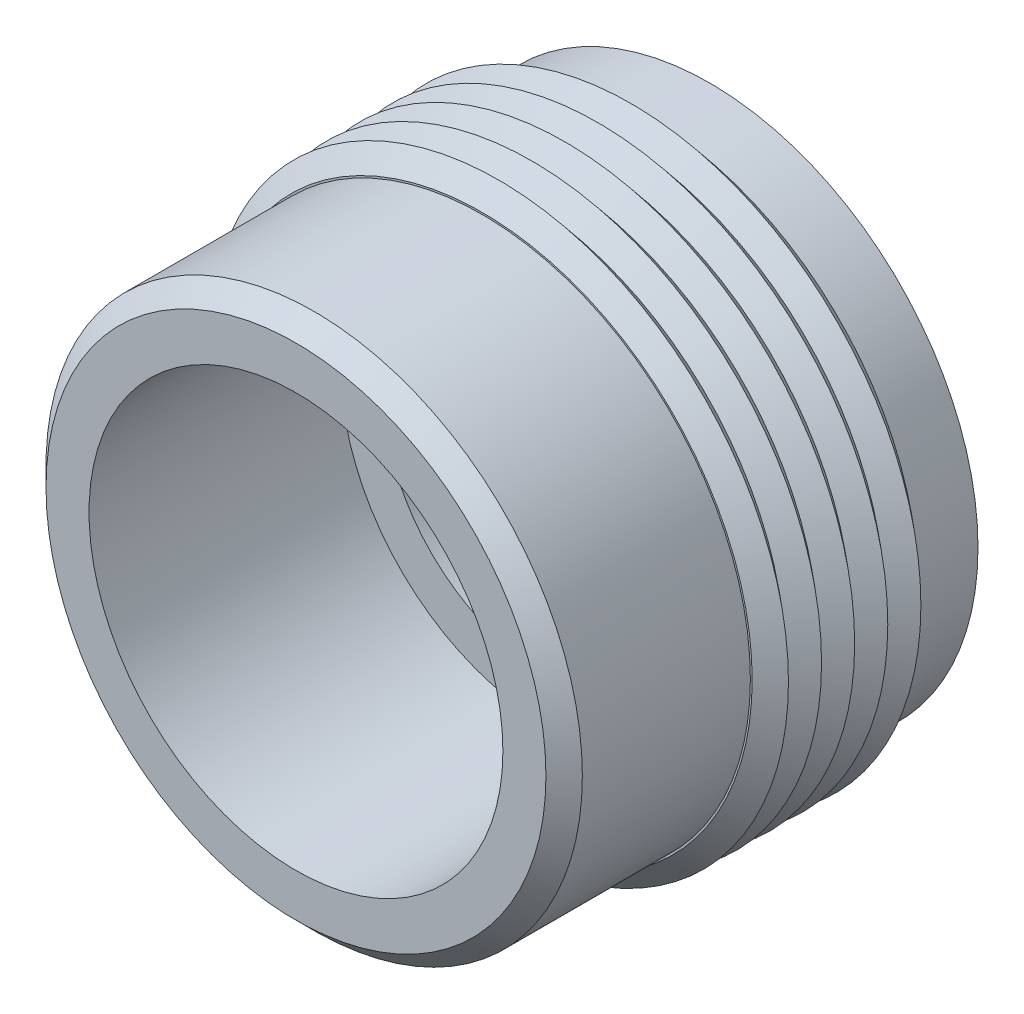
ISO-10303-21;
HEADER;
FILE_DESCRIPTION(('STEP AP214'),'2;1');
FILE_NAME('part.step','',(''),(''),'','','');
FILE_SCHEMA(('AUTOMOTIVE_DESIGN { 1 0 10303 214 1 1 1 1 }'));
ENDSEC;
DATA;
#1=APPLICATION_CONTEXT('core data for automotive mechanical design processes');
#2=APPLICATION_PROTOCOL_DEFINITION('international standard','automotive_design',2000,#1);
#3=PRODUCT_CONTEXT('',#1,'mechanical');
#4=PRODUCT('Part','Part','',(#3));
#5=PRODUCT_RELATED_PRODUCT_CATEGORY('part','',(#4));
#6=PRODUCT_DEFINITION_FORMATION('','',#4);
#7=PRODUCT_DEFINITION_CONTEXT('part definition',#1,'design');
#8=PRODUCT_DEFINITION('design','',#6,#7);
#9=PRODUCT_DEFINITION_SHAPE('','',#8);
#10=(LENGTH_UNIT() NAMED_UNIT(*) SI_UNIT(.MILLI.,.METRE.));
#11=(NAMED_UNIT(*) PLANE_ANGLE_UNIT() SI_UNIT($,.RADIAN.));
#12=(NAMED_UNIT(*) SI_UNIT($,.STERADIAN.) SOLID_ANGLE_UNIT());
#13=UNCERTAINTY_MEASURE_WITH_UNIT(LENGTH_MEASURE(1.E-05),#10,'distance_accuracy_value','');
#14=(GEOMETRIC_REPRESENTATION_CONTEXT(3) GLOBAL_UNCERTAINTY_ASSIGNED_CONTEXT((#13)) GLOBAL_UNIT_ASSIGNED_CONTEXT((#10,
#11,#12)) REPRESENTATION_CONTEXT('',''));
#15=CARTESIAN_POINT('',(0.,0.,0.));
#16=DIRECTION('',(0.,0.,1.));
#17=DIRECTION('',(1.,0.,0.));
#18=AXIS2_PLACEMENT_3D('',#15,#16,#17);
#19=CARTESIAN_POINT('',(0.,10.287,15.875));
#20=DIRECTION('',(0.,0.,-1.));
#21=DIRECTION('',(-1.,0.,0.));
#22=AXIS2_PLACEMENT_3D('',#19,#20,#21);
#23=PLANE('',#22);
#24=CARTESIAN_POINT('',(0.,0.,15.875));
#25=DIRECTION('',(0.,0.,1.));
#26=DIRECTION('',(1.,0.,0.));
#27=AXIS2_PLACEMENT_3D('',#24,#25,#26);
#28=CIRCLE('',#27,7.9375);
#29=CARTESIAN_POINT('',(7.9375,0.,15.875));
#30=VERTEX_POINT('',#29);
#31=EDGE_CURVE('E54',#30,#30,#28,.T.);
#32=ORIENTED_EDGE('',*,*,#31,.F.);
#33=EDGE_LOOP('',(#32));
#34=FACE_BOUND('',#33,.T.);
#35=CARTESIAN_POINT('',(0.,0.,15.875));
#36=DIRECTION('',(0.,0.,1.));
#37=DIRECTION('',(1.,0.,0.));
#38=AXIS2_PLACEMENT_3D('',#35,#36,#37);
#39=CIRCLE('',#38,9.5885);
#40=CARTESIAN_POINT('',(9.5885,0.,15.875));
#41=VERTEX_POINT('',#40);
#42=EDGE_CURVE('E99',#41,#41,#39,.T.);
#43=ORIENTED_EDGE('',*,*,#42,.T.);
#44=EDGE_LOOP('',(#43));
#45=FACE_BOUND('',#44,.T.);
#46=ADVANCED_FACE('F34',(#34,#45),#23,.F.);
#47=CARTESIAN_POINT('',(0.,0.,0.));
#48=DIRECTION('',(0.,0.,1.));
#49=DIRECTION('',(1.,0.,0.));
#50=AXIS2_PLACEMENT_3D('',#47,#48,#49);
#51=CYLINDRICAL_SURFACE('',#50,10.287);
#52=CARTESIAN_POINT('',(0.,0.,8.73125000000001));
#53=DIRECTION('',(0.,0.,1.));
#54=DIRECTION('',(1.,0.,0.));
#55=AXIS2_PLACEMENT_3D('',#52,#53,#54);
#56=CIRCLE('',#55,10.287);
#57=CARTESIAN_POINT('',(10.287,0.,8.73125000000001));
#58=VERTEX_POINT('',#57);
#59=EDGE_CURVE('E10',#58,#58,#56,.T.);
#60=ORIENTED_EDGE('',*,*,#59,.T.);
#61=EDGE_LOOP('',(#60));
#62=FACE_BOUND('',#61,.T.);
#63=CARTESIAN_POINT('',(0.,0.,15.1765));
#64=DIRECTION('',(0.,0.,1.));
#65=DIRECTION('',(1.,0.,0.));
#66=AXIS2_PLACEMENT_3D('',#63,#64,#65);
#67=CIRCLE('',#66,10.287);
#68=CARTESIAN_POINT('',(10.287,0.,15.1765));
#69=VERTEX_POINT('',#68);
#70=EDGE_CURVE('E96',#69,#69,#67,.T.);
#71=ORIENTED_EDGE('',*,*,#70,.F.);
#72=EDGE_LOOP('',(#71));
#73=FACE_BOUND('',#72,.T.);
#74=ADVANCED_FACE('F116',(#62,#73),#51,.T.);
#75=CARTESIAN_POINT('',(0.,10.287,2.38125));
#76=DIRECTION('',(0.,0.,1.));
#77=DIRECTION('',(1.,0.,0.));
#78=AXIS2_PLACEMENT_3D('',#75,#76,#77);
#79=PLANE('',#78);
#80=CARTESIAN_POINT('',(0.,0.,2.38125000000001));
#81=DIRECTION('',(0.,0.,1.));
#82=DIRECTION('',(1.,0.,0.));
#83=AXIS2_PLACEMENT_3D('',#80,#81,#82);
#84=CIRCLE('',#83,10.35685);
#85=CARTESIAN_POINT('',(10.35685,0.,2.38125000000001));
#86=VERTEX_POINT('',#85);
#87=EDGE_CURVE('E61',#86,#86,#84,.T.);
#88=ORIENTED_EDGE('',*,*,#87,.F.);
#89=EDGE_LOOP('',(#88));
#90=FACE_BOUND('',#89,.T.);
#91=CARTESIAN_POINT('',(0.,0.,2.38125));
#92=DIRECTION('',(0.,0.,1.));
#93=DIRECTION('',(1.,0.,0.));
#94=AXIS2_PLACEMENT_3D('',#91,#92,#93);
#95=CIRCLE('',#94,10.287);
#96=CARTESIAN_POINT('',(10.287,0.,2.38125));
#97=VERTEX_POINT('',#96);
#98=EDGE_CURVE('E45',#97,#97,#95,.T.);
#99=ORIENTED_EDGE('',*,*,#98,.T.);
#100=EDGE_LOOP('',(#99));
#101=FACE_BOUND('',#100,.T.);
#102=ADVANCED_FACE('F36',(#90,#101),#79,.F.);
#103=CARTESIAN_POINT('',(0.,11.1125,8.73125000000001));
#104=DIRECTION('',(0.,0.,-1.));
#105=DIRECTION('',(-1.,0.,0.));
#106=AXIS2_PLACEMENT_3D('',#103,#104,#105);
#107=PLANE('',#106);
#108=CARTESIAN_POINT('',(0.,0.,8.73125000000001));
#109=DIRECTION('',(0.,0.,1.));
#110=DIRECTION('',(1.,0.,0.));
#111=AXIS2_PLACEMENT_3D('',#108,#109,#110);
#112=CIRCLE('',#111,10.35685);
#113=CARTESIAN_POINT('',(10.35685,0.,8.73125000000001));
#114=VERTEX_POINT('',#113);
#115=EDGE_CURVE('E93',#114,#114,#112,.T.);
#116=ORIENTED_EDGE('',*,*,#115,.T.);
#117=EDGE_LOOP('',(#116));
#118=FACE_BOUND('',#117,.T.);
#119=ORIENTED_EDGE('',*,*,#59,.F.);
#120=EDGE_LOOP('',(#119));
#121=FACE_BOUND('',#120,.T.);
#122=ADVANCED_FACE('F127',(#118,#121),#107,.F.);
#123=CARTESIAN_POINT('',(0.,10.287,0.));
#124=DIRECTION('',(0.,0.,1.));
#125=DIRECTION('',(1.,0.,0.));
#126=AXIS2_PLACEMENT_3D('',#123,#124,#125);
#127=PLANE('',#126);
#128=CARTESIAN_POINT('',(0.,0.,0.));
#129=DIRECTION('',(0.,0.,1.));
#130=DIRECTION('',(1.,0.,0.));
#131=AXIS2_PLACEMENT_3D('',#128,#129,#130);
#132=CIRCLE('',#131,6.2992);
#133=CARTESIAN_POINT('',(6.2992,0.,0.));
#134=VERTEX_POINT('',#133);
#135=EDGE_CURVE('E57',#134,#134,#132,.T.);
#136=ORIENTED_EDGE('',*,*,#135,.T.);
#137=EDGE_LOOP('',(#136));
#138=FACE_BOUND('',#137,.T.);
#139=CARTESIAN_POINT('',(0.,0.,0.));
#140=DIRECTION('',(0.,0.,1.));
#141=DIRECTION('',(1.,0.,0.));
#142=AXIS2_PLACEMENT_3D('',#139,#140,#141);
#143=CIRCLE('',#142,10.287);
#144=CARTESIAN_POINT('',(10.287,0.,0.));
#145=VERTEX_POINT('',#144);
#146=EDGE_CURVE('E41',#145,#145,#143,.T.);
#147=ORIENTED_EDGE('',*,*,#146,.F.);
#148=EDGE_LOOP('',(#147));
#149=FACE_BOUND('',#148,.T.);
#150=ADVANCED_FACE('F125',(#138,#149),#127,.F.);
#151=CARTESIAN_POINT('',(0.,0.,0.));
#152=DIRECTION('',(0.,0.,1.));
#153=DIRECTION('',(1.,0.,0.));
#154=AXIS2_PLACEMENT_3D('',#151,#152,#153);
#155=CYLINDRICAL_SURFACE('',#154,10.287);
#156=ORIENTED_EDGE('',*,*,#98,.F.);
#157=EDGE_LOOP('',(#156));
#158=FACE_BOUND('',#157,.T.);
#159=ORIENTED_EDGE('',*,*,#146,.T.);
#160=EDGE_LOOP('',(#159));
#161=FACE_BOUND('',#160,.T.);
#162=ADVANCED_FACE('F134',(#158,#161),#155,.T.);
#163=CARTESIAN_POINT('',(0.,7.9375,6.22300000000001));
#164=DIRECTION('',(0.,0.,1.));
#165=DIRECTION('',(1.,0.,0.));
#166=AXIS2_PLACEMENT_3D('',#163,#164,#165);
#167=PLANE('',#166);
#168=CARTESIAN_POINT('',(0.,0.,6.22300000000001));
#169=DIRECTION('',(0.,0.,1.));
#170=DIRECTION('',(1.,0.,0.));
#171=AXIS2_PLACEMENT_3D('',#168,#169,#170);
#172=CIRCLE('',#171,6.2992);
#173=CARTESIAN_POINT('',(6.2992,0.,6.22300000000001));
#174=VERTEX_POINT('',#173);
#175=EDGE_CURVE('E58',#174,#174,#172,.T.);
#176=ORIENTED_EDGE('',*,*,#175,.F.);
#177=EDGE_LOOP('',(#176));
#178=FACE_BOUND('',#177,.T.);
#179=CARTESIAN_POINT('',(0.,0.,6.22300000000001));
#180=DIRECTION('',(0.,0.,1.));
#181=DIRECTION('',(1.,0.,0.));
#182=AXIS2_PLACEMENT_3D('',#179,#180,#181);
#183=CIRCLE('',#182,7.9375);
#184=CARTESIAN_POINT('',(7.9375,0.,6.22300000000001));
#185=VERTEX_POINT('',#184);
#186=EDGE_CURVE('E49',#185,#185,#183,.T.);
#187=ORIENTED_EDGE('',*,*,#186,.T.);
#188=EDGE_LOOP('',(#187));
#189=FACE_BOUND('',#188,.T.);
#190=ADVANCED_FACE('F199',(#178,#189),#167,.T.);
#191=CARTESIAN_POINT('',(0.,0.,0.));
#192=DIRECTION('',(0.,0.,1.));
#193=DIRECTION('',(1.,0.,0.));
#194=AXIS2_PLACEMENT_3D('',#191,#192,#193);
#195=CYLINDRICAL_SURFACE('',#194,7.9375);
#196=ORIENTED_EDGE('',*,*,#31,.T.);
#197=EDGE_LOOP('',(#196));
#198=FACE_BOUND('',#197,.T.);
#199=ORIENTED_EDGE('',*,*,#186,.F.);
#200=EDGE_LOOP('',(#199));
#201=FACE_BOUND('',#200,.T.);
#202=ADVANCED_FACE('F203',(#198,#201),#195,.F.);
#203=CARTESIAN_POINT('',(0.,0.,0.));
#204=DIRECTION('',(0.,0.,1.));
#205=DIRECTION('',(1.,0.,0.));
#206=AXIS2_PLACEMENT_3D('',#203,#204,#205);
#207=CYLINDRICAL_SURFACE('',#206,6.2992);
#208=ORIENTED_EDGE('',*,*,#135,.F.);
#209=EDGE_LOOP('',(#208));
#210=FACE_BOUND('',#209,.T.);
#211=ORIENTED_EDGE('',*,*,#175,.T.);
#212=EDGE_LOOP('',(#211));
#213=FACE_BOUND('',#212,.T.);
#214=ADVANCED_FACE('F192',(#210,#213),#207,.F.);
#215=CARTESIAN_POINT('',(0.,0.,2.38125000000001));
#216=DIRECTION('',(0.,0.,1.));
#217=DIRECTION('',(1.,0.,0.));
#218=AXIS2_PLACEMENT_3D('',#215,#216,#217);
#219=CONICAL_SURFACE('',#218,10.35685,0.871939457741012);
#220=CARTESIAN_POINT('',(0.,0.,3.01625000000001));
#221=DIRECTION('',(0.,0.,1.));
#222=DIRECTION('',(1.,0.,0.));
#223=AXIS2_PLACEMENT_3D('',#220,#221,#222);
#224=CIRCLE('',#223,11.1125);
#225=CARTESIAN_POINT('',(11.1125,0.,3.01625000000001));
#226=VERTEX_POINT('',#225);
#227=EDGE_CURVE('E66',#226,#226,#224,.T.);
#228=ORIENTED_EDGE('',*,*,#227,.F.);
#229=EDGE_LOOP('',(#228));
#230=FACE_BOUND('',#229,.T.);
#231=ORIENTED_EDGE('',*,*,#87,.T.);
#232=EDGE_LOOP('',(#231));
#233=FACE_BOUND('',#232,.T.);
#234=ADVANCED_FACE('F186',(#230,#233),#219,.T.);
#235=CARTESIAN_POINT('',(0.,0.,3.01625000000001));
#236=DIRECTION('',(0.,0.,-1.));
#237=DIRECTION('',(-1.,0.,0.));
#238=AXIS2_PLACEMENT_3D('',#235,#236,#237);
#239=CONICAL_SURFACE('',#238,11.1125,0.871939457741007);
#240=CARTESIAN_POINT('',(0.,0.,3.65125000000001));
#241=DIRECTION('',(0.,0.,1.));
#242=DIRECTION('',(1.,0.,0.));
#243=AXIS2_PLACEMENT_3D('',#240,#241,#242);
#244=CIRCLE('',#243,10.35685);
#245=CARTESIAN_POINT('',(10.35685,0.,3.65125000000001));
#246=VERTEX_POINT('',#245);
#247=EDGE_CURVE('E69',#246,#246,#244,.T.);
#248=ORIENTED_EDGE('',*,*,#247,.F.);
#249=EDGE_LOOP('',(#248));
#250=FACE_BOUND('',#249,.T.);
#251=ORIENTED_EDGE('',*,*,#227,.T.);
#252=EDGE_LOOP('',(#251));
#253=FACE_BOUND('',#252,.T.);
#254=ADVANCED_FACE('F180',(#250,#253),#239,.T.);
#255=CARTESIAN_POINT('',(0.,0.,3.65125000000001));
#256=DIRECTION('',(0.,0.,1.));
#257=DIRECTION('',(1.,0.,0.));
#258=AXIS2_PLACEMENT_3D('',#255,#256,#257);
#259=CONICAL_SURFACE('',#258,10.35685,0.871939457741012);
#260=CARTESIAN_POINT('',(0.,0.,4.28625000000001));
#261=DIRECTION('',(0.,0.,1.));
#262=DIRECTION('',(1.,0.,0.));
#263=AXIS2_PLACEMENT_3D('',#260,#261,#262);
#264=CIRCLE('',#263,11.1125);
#265=CARTESIAN_POINT('',(11.1125,0.,4.28625000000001));
#266=VERTEX_POINT('',#265);
#267=EDGE_CURVE('E72',#266,#266,#264,.T.);
#268=ORIENTED_EDGE('',*,*,#267,.F.);
#269=EDGE_LOOP('',(#268));
#270=FACE_BOUND('',#269,.T.);
#271=ORIENTED_EDGE('',*,*,#247,.T.);
#272=EDGE_LOOP('',(#271));
#273=FACE_BOUND('',#272,.T.);
#274=ADVANCED_FACE('F174',(#270,#273),#259,.T.);
#275=CARTESIAN_POINT('',(0.,0.,4.28625000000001));
#276=DIRECTION('',(0.,0.,-1.));
#277=DIRECTION('',(-1.,0.,0.));
#278=AXIS2_PLACEMENT_3D('',#275,#276,#277);
#279=CONICAL_SURFACE('',#278,11.1125,0.871939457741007);
#280=CARTESIAN_POINT('',(0.,0.,4.92125000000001));
#281=DIRECTION('',(0.,0.,1.));
#282=DIRECTION('',(1.,0.,0.));
#283=AXIS2_PLACEMENT_3D('',#280,#281,#282);
#284=CIRCLE('',#283,10.35685);
#285=CARTESIAN_POINT('',(10.35685,0.,4.92125000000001));
#286=VERTEX_POINT('',#285);
#287=EDGE_CURVE('E75',#286,#286,#284,.T.);
#288=ORIENTED_EDGE('',*,*,#287,.F.);
#289=EDGE_LOOP('',(#288));
#290=FACE_BOUND('',#289,.T.);
#291=ORIENTED_EDGE('',*,*,#267,.T.);
#292=EDGE_LOOP('',(#291));
#293=FACE_BOUND('',#292,.T.);
#294=ADVANCED_FACE('F168',(#290,#293),#279,.T.);
#295=CARTESIAN_POINT('',(0.,0.,4.92125000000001));
#296=DIRECTION('',(0.,0.,1.));
#297=DIRECTION('',(1.,0.,0.));
#298=AXIS2_PLACEMENT_3D('',#295,#296,#297);
#299=CONICAL_SURFACE('',#298,10.35685,0.871939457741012);
#300=CARTESIAN_POINT('',(0.,0.,5.55625000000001));
#301=DIRECTION('',(0.,0.,1.));
#302=DIRECTION('',(1.,0.,0.));
#303=AXIS2_PLACEMENT_3D('',#300,#301,#302);
#304=CIRCLE('',#303,11.1125);
#305=CARTESIAN_POINT('',(11.1125,0.,5.55625000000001));
#306=VERTEX_POINT('',#305);
#307=EDGE_CURVE('E78',#306,#306,#304,.T.);
#308=ORIENTED_EDGE('',*,*,#307,.F.);
#309=EDGE_LOOP('',(#308));
#310=FACE_BOUND('',#309,.T.);
#311=ORIENTED_EDGE('',*,*,#287,.T.);
#312=EDGE_LOOP('',(#311));
#313=FACE_BOUND('',#312,.T.);
#314=ADVANCED_FACE('F162',(#310,#313),#299,.T.);
#315=CARTESIAN_POINT('',(0.,0.,5.55625000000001));
#316=DIRECTION('',(0.,0.,-1.));
#317=DIRECTION('',(-1.,0.,0.));
#318=AXIS2_PLACEMENT_3D('',#315,#316,#317);
#319=CONICAL_SURFACE('',#318,11.1125,0.871939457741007);
#320=CARTESIAN_POINT('',(0.,0.,6.19125000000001));
#321=DIRECTION('',(0.,0.,1.));
#322=DIRECTION('',(1.,0.,0.));
#323=AXIS2_PLACEMENT_3D('',#320,#321,#322);
#324=CIRCLE('',#323,10.35685);
#325=CARTESIAN_POINT('',(10.35685,0.,6.19125000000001));
#326=VERTEX_POINT('',#325);
#327=EDGE_CURVE('E81',#326,#326,#324,.T.);
#328=ORIENTED_EDGE('',*,*,#327,.F.);
#329=EDGE_LOOP('',(#328));
#330=FACE_BOUND('',#329,.T.);
#331=ORIENTED_EDGE('',*,*,#307,.T.);
#332=EDGE_LOOP('',(#331));
#333=FACE_BOUND('',#332,.T.);
#334=ADVANCED_FACE('F156',(#330,#333),#319,.T.);
#335=CARTESIAN_POINT('',(0.,0.,6.19125000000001));
#336=DIRECTION('',(0.,0.,1.));
#337=DIRECTION('',(1.,0.,0.));
#338=AXIS2_PLACEMENT_3D('',#335,#336,#337);
#339=CONICAL_SURFACE('',#338,10.35685,0.871939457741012);
#340=CARTESIAN_POINT('',(0.,0.,6.82625000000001));
#341=DIRECTION('',(0.,0.,1.));
#342=DIRECTION('',(1.,0.,0.));
#343=AXIS2_PLACEMENT_3D('',#340,#341,#342);
#344=CIRCLE('',#343,11.1125);
#345=CARTESIAN_POINT('',(11.1125,0.,6.82625000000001));
#346=VERTEX_POINT('',#345);
#347=EDGE_CURVE('E84',#346,#346,#344,.T.);
#348=ORIENTED_EDGE('',*,*,#347,.F.);
#349=EDGE_LOOP('',(#348));
#350=FACE_BOUND('',#349,.T.);
#351=ORIENTED_EDGE('',*,*,#327,.T.);
#352=EDGE_LOOP('',(#351));
#353=FACE_BOUND('',#352,.T.);
#354=ADVANCED_FACE('F150',(#350,#353),#339,.T.);
#355=CARTESIAN_POINT('',(0.,0.,6.82625000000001));
#356=DIRECTION('',(0.,0.,-1.));
#357=DIRECTION('',(-1.,0.,0.));
#358=AXIS2_PLACEMENT_3D('',#355,#356,#357);
#359=CONICAL_SURFACE('',#358,11.1125,0.871939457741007);
#360=CARTESIAN_POINT('',(0.,0.,7.46125000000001));
#361=DIRECTION('',(0.,0.,1.));
#362=DIRECTION('',(1.,0.,0.));
#363=AXIS2_PLACEMENT_3D('',#360,#361,#362);
#364=CIRCLE('',#363,10.35685);
#365=CARTESIAN_POINT('',(10.35685,0.,7.46125000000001));
#366=VERTEX_POINT('',#365);
#367=EDGE_CURVE('E87',#366,#366,#364,.T.);
#368=ORIENTED_EDGE('',*,*,#367,.F.);
#369=EDGE_LOOP('',(#368));
#370=FACE_BOUND('',#369,.T.);
#371=ORIENTED_EDGE('',*,*,#347,.T.);
#372=EDGE_LOOP('',(#371));
#373=FACE_BOUND('',#372,.T.);
#374=ADVANCED_FACE('F144',(#370,#373),#359,.T.);
#375=CARTESIAN_POINT('',(0.,0.,7.46125000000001));
#376=DIRECTION('',(0.,0.,1.));
#377=DIRECTION('',(1.,0.,0.));
#378=AXIS2_PLACEMENT_3D('',#375,#376,#377);
#379=CONICAL_SURFACE('',#378,10.35685,0.871939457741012);
#380=CARTESIAN_POINT('',(0.,0.,8.09625000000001));
#381=DIRECTION('',(0.,0.,1.));
#382=DIRECTION('',(1.,0.,0.));
#383=AXIS2_PLACEMENT_3D('',#380,#381,#382);
#384=CIRCLE('',#383,11.1125);
#385=CARTESIAN_POINT('',(11.1125,0.,8.09625000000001));
#386=VERTEX_POINT('',#385);
#387=EDGE_CURVE('E90',#386,#386,#384,.T.);
#388=ORIENTED_EDGE('',*,*,#387,.F.);
#389=EDGE_LOOP('',(#388));
#390=FACE_BOUND('',#389,.T.);
#391=ORIENTED_EDGE('',*,*,#367,.T.);
#392=EDGE_LOOP('',(#391));
#393=FACE_BOUND('',#392,.T.);
#394=ADVANCED_FACE('F112',(#390,#393),#379,.T.);
#395=CARTESIAN_POINT('',(0.,0.,8.09625000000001));
#396=DIRECTION('',(0.,0.,-1.));
#397=DIRECTION('',(-1.,0.,0.));
#398=AXIS2_PLACEMENT_3D('',#395,#396,#397);
#399=CONICAL_SURFACE('',#398,11.1125,0.871939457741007);
#400=ORIENTED_EDGE('',*,*,#115,.F.);
#401=EDGE_LOOP('',(#400));
#402=FACE_BOUND('',#401,.T.);
#403=ORIENTED_EDGE('',*,*,#387,.T.);
#404=EDGE_LOOP('',(#403));
#405=FACE_BOUND('',#404,.T.);
#406=ADVANCED_FACE('F106',(#402,#405),#399,.T.);
#407=CARTESIAN_POINT('',(0.,0.,15.875));
#408=DIRECTION('',(0.,0.,-1.));
#409=DIRECTION('',(-1.,0.,0.));
#410=AXIS2_PLACEMENT_3D('',#407,#408,#409);
#411=CONICAL_SURFACE('',#410,9.5885,0.785398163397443);
#412=ORIENTED_EDGE('',*,*,#70,.T.);
#413=EDGE_LOOP('',(#412));
#414=FACE_BOUND('',#413,.T.);
#415=ORIENTED_EDGE('',*,*,#42,.F.);
#416=EDGE_LOOP('',(#415));
#417=FACE_BOUND('',#416,.T.);
#418=ADVANCED_FACE('F104',(#414,#417),#411,.T.);
#419=CLOSED_SHELL('',(#46,#74,#102,#122,#150,#162,#190,#202,#214,#234,#254,#274,#294,#314,#334,
#354,#374,#394,#406,#418));
#420=MANIFOLD_SOLID_BREP('B2',#419);
#421=ADVANCED_BREP_SHAPE_REPRESENTATION('',(#18,#420),#14);
#422=SHAPE_DEFINITION_REPRESENTATION(#9,#421);
ENDSEC;
END-ISO-10303-21;
